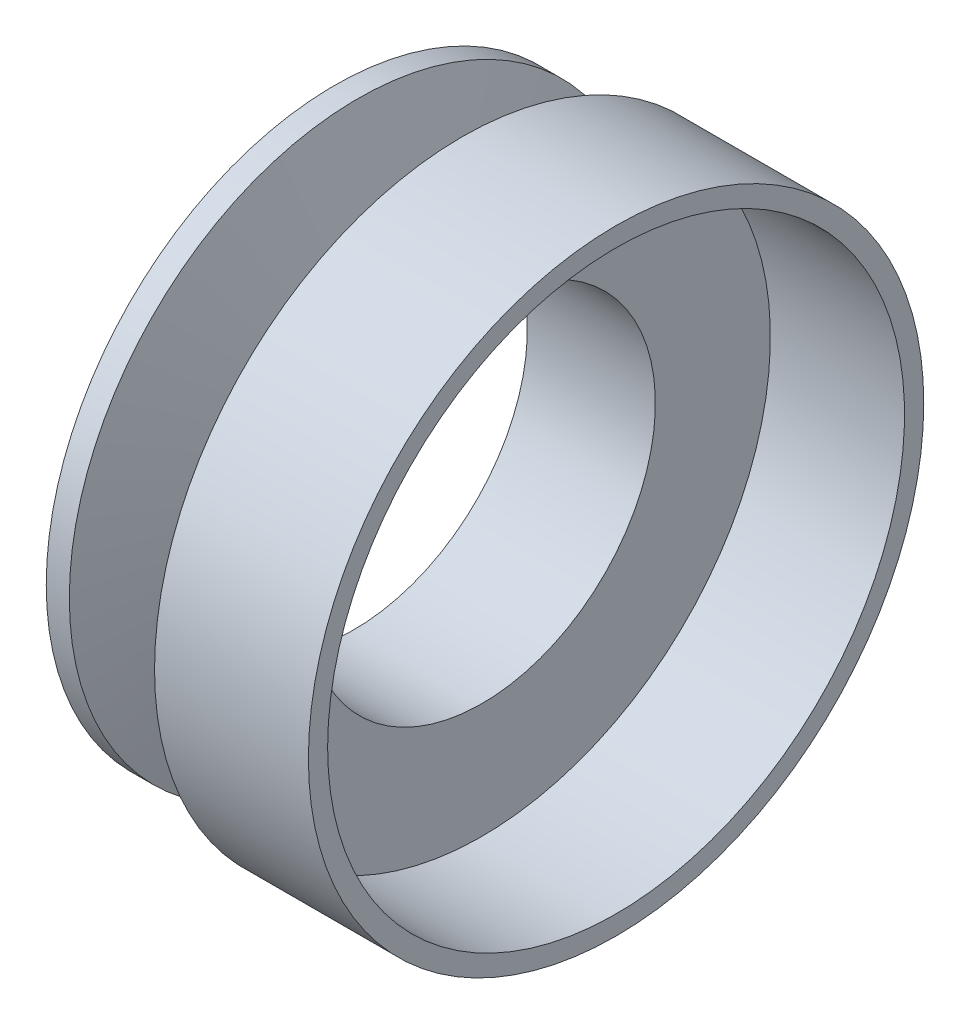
from build123d import *


with BuildPart() as part:
    # Esquisse2 → R_volution1 (revolve)
    with BuildSketch(Plane.XY, mode=Mode.PRIVATE) as r_volution1_sk:
        Polygon((0, 26.15), (0, 37.5), (3, 37.5), (6.58, 24.15), (16.58, 24.15), (16.58, 40), (36.58, 40), (36.58, 37.5), (19.14, 37.5), (19.14, 22.55), (2.5, 22.55), (2.5, 26.15), align=None)
    revolve(r_volution1_sk.sketch.rotate(Axis((0, 0, 0), (1, 0, 0)), 90), axis=Axis((0, 0, 0), (1, 0, 0)))


solid = part.part
